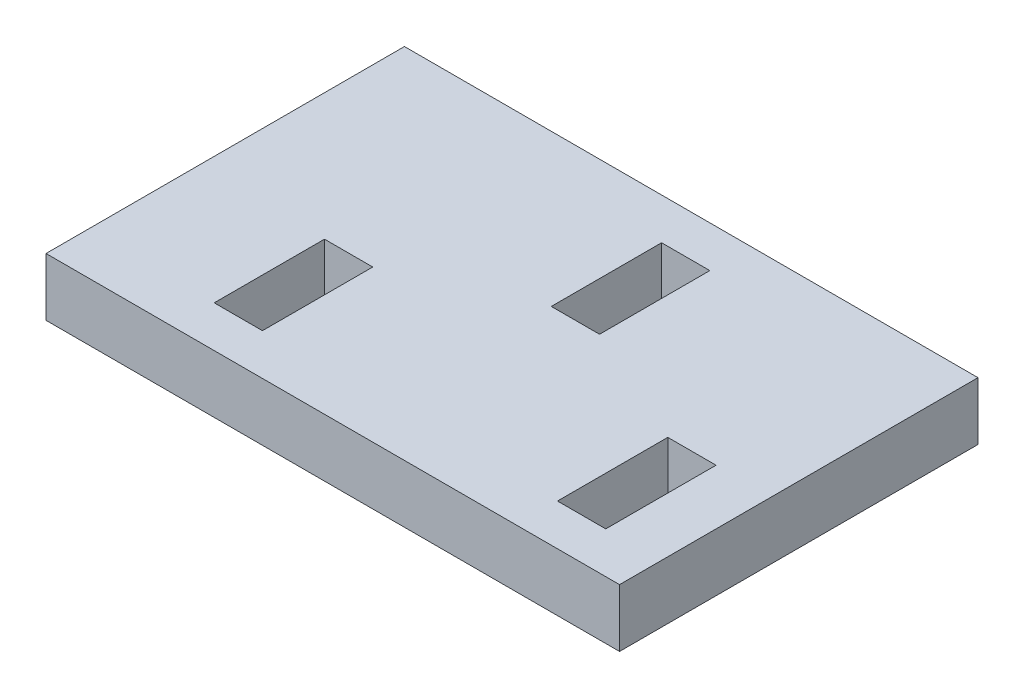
from build123d import *

# Parameters (mm, degrees)
SKETCH1_W           = 52.832
SKETCH1_H           = 33.02
BOSS_EXTRUDE1_DEPTH = 5.334
SKETCH2_W           = 4.445
SKETCH2_H           = 10.16
CUT_EXTRUDE1_DEPTH  = 32.604378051


with BuildPart() as part:
    # Sketch1 → Boss-Extrude1 (new body)
    with BuildSketch(Plane(origin=(0, 0, 0), x_dir=(1, 0, 0), z_dir=(0, 1, 0))):
        Rectangle(SKETCH1_W, SKETCH1_H)
    extrude(amount=BOSS_EXTRUDE1_DEPTH)

    # Sketch2 → Cut-Extrude1 (cut, through all)
    with BuildSketch(Plane(origin=(0, 5.334, 0), x_dir=(1, 0, 0), z_dir=(0, 1, 0))):
        with Locations((19.1135, -7.62)):
            Rectangle(SKETCH2_W, SKETCH2_H)
        with Locations((3.302, 7.62)):
            Rectangle(SKETCH2_W, SKETCH2_H)
        with Locations((-12.5095, -7.62)):
            Rectangle(SKETCH2_W, SKETCH2_H)
    extrude(amount=-CUT_EXTRUDE1_DEPTH, mode=Mode.SUBTRACT)


solid = part.part
